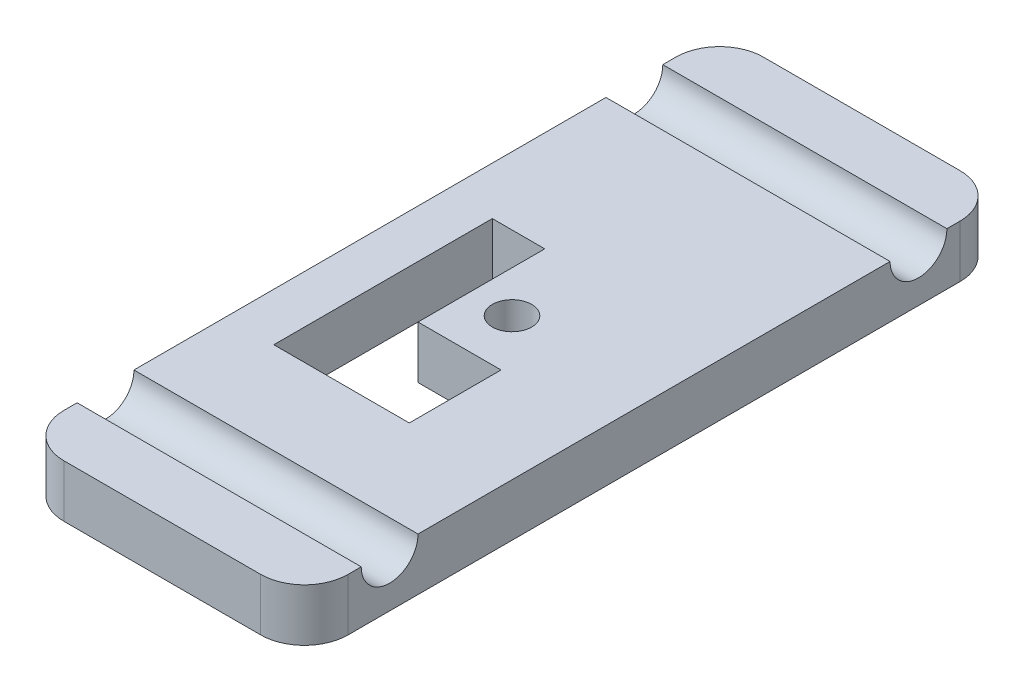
ISO-10303-21;
HEADER;
FILE_DESCRIPTION(('STEP AP214'),'2;1');
FILE_NAME('part.step','',(''),(''),'','','');
FILE_SCHEMA(('AUTOMOTIVE_DESIGN { 1 0 10303 214 1 1 1 1 }'));
ENDSEC;
DATA;
#1=APPLICATION_CONTEXT('core data for automotive mechanical design processes');
#2=APPLICATION_PROTOCOL_DEFINITION('international standard','automotive_design',2000,#1);
#3=PRODUCT_CONTEXT('',#1,'mechanical');
#4=PRODUCT('Part','Part','',(#3));
#5=PRODUCT_RELATED_PRODUCT_CATEGORY('part','',(#4));
#6=PRODUCT_DEFINITION_FORMATION('','',#4);
#7=PRODUCT_DEFINITION_CONTEXT('part definition',#1,'design');
#8=PRODUCT_DEFINITION('design','',#6,#7);
#9=PRODUCT_DEFINITION_SHAPE('','',#8);
#10=(LENGTH_UNIT() NAMED_UNIT(*) SI_UNIT(.MILLI.,.METRE.));
#11=(NAMED_UNIT(*) PLANE_ANGLE_UNIT() SI_UNIT($,.RADIAN.));
#12=(NAMED_UNIT(*) SI_UNIT($,.STERADIAN.) SOLID_ANGLE_UNIT());
#13=UNCERTAINTY_MEASURE_WITH_UNIT(LENGTH_MEASURE(1.E-05),#10,'distance_accuracy_value','');
#14=(GEOMETRIC_REPRESENTATION_CONTEXT(3) GLOBAL_UNCERTAINTY_ASSIGNED_CONTEXT((#13)) GLOBAL_UNIT_ASSIGNED_CONTEXT((#10,
#11,#12)) REPRESENTATION_CONTEXT('',''));
#15=CARTESIAN_POINT('',(0.,0.,0.));
#16=DIRECTION('',(0.,0.,1.));
#17=DIRECTION('',(1.,0.,0.));
#18=AXIS2_PLACEMENT_3D('',#15,#16,#17);
#19=CARTESIAN_POINT('',(0.,0.,0.));
#20=DIRECTION('',(0.,1.,0.));
#21=DIRECTION('',(0.,0.,1.));
#22=AXIS2_PLACEMENT_3D('',#19,#20,#21);
#23=PLANE('',#22);
#24=DIRECTION('',(-1.,0.,0.));
#25=VECTOR('',#24,1.);
#26=CARTESIAN_POINT('',(-32.5,0.,-80.));
#27=LINE('',#26,#25);
#28=CARTESIAN_POINT('',(22.5,0.,-80.));
#29=VERTEX_POINT('',#28);
#30=CARTESIAN_POINT('',(-22.5,0.,-80.));
#31=VERTEX_POINT('',#30);
#32=EDGE_CURVE('E190',#29,#31,#27,.T.);
#33=ORIENTED_EDGE('',*,*,#32,.T.);
#34=CARTESIAN_POINT('',(-22.5,0.,-70.));
#35=DIRECTION('',(0.,1.,0.));
#36=DIRECTION('',(0.,0.,1.));
#37=AXIS2_PLACEMENT_3D('',#34,#35,#36);
#38=CIRCLE('',#37,10.);
#39=CARTESIAN_POINT('',(-32.5,0.,-70.));
#40=VERTEX_POINT('',#39);
#41=EDGE_CURVE('E209',#31,#40,#38,.T.);
#42=ORIENTED_EDGE('',*,*,#41,.T.);
#43=DIRECTION('',(0.,0.,1.));
#44=VECTOR('',#43,1.);
#45=CARTESIAN_POINT('',(-32.5,0.,-80.));
#46=LINE('',#45,#44);
#47=CARTESIAN_POINT('',(-32.5,0.,-67.));
#48=VERTEX_POINT('',#47);
#49=EDGE_CURVE('E187',#40,#48,#46,.T.);
#50=ORIENTED_EDGE('',*,*,#49,.T.);
#51=DIRECTION('',(-1.,0.,0.));
#52=VECTOR('',#51,1.);
#53=CARTESIAN_POINT('',(44.5,0.,-67.));
#54=LINE('',#53,#52);
#55=CARTESIAN_POINT('',(32.5,0.,-67.));
#56=VERTEX_POINT('',#55);
#57=EDGE_CURVE('E199',#56,#48,#54,.T.);
#58=ORIENTED_EDGE('',*,*,#57,.F.);
#59=DIRECTION('',(0.,0.,-1.));
#60=VECTOR('',#59,1.);
#61=CARTESIAN_POINT('',(32.5,0.,-80.));
#62=LINE('',#61,#60);
#63=CARTESIAN_POINT('',(32.5,0.,-70.));
#64=VERTEX_POINT('',#63);
#65=EDGE_CURVE('E245',#56,#64,#62,.T.);
#66=ORIENTED_EDGE('',*,*,#65,.T.);
#67=CARTESIAN_POINT('',(22.5,0.,-70.));
#68=DIRECTION('',(0.,1.,0.));
#69=DIRECTION('',(0.,0.,1.));
#70=AXIS2_PLACEMENT_3D('',#67,#68,#69);
#71=CIRCLE('',#70,10.);
#72=EDGE_CURVE('E207',#64,#29,#71,.T.);
#73=ORIENTED_EDGE('',*,*,#72,.T.);
#74=EDGE_LOOP('',(#33,#42,#50,#58,#66,#73));
#75=FACE_BOUND('',#74,.T.);
#76=ADVANCED_FACE('F35',(#75),#23,.T.);
#77=DIRECTION('',(-1.,0.,0.));
#78=VECTOR('',#77,1.);
#79=CARTESIAN_POINT('',(44.5,0.,-54.));
#80=LINE('',#79,#78);
#81=CARTESIAN_POINT('',(-32.5,0.,-54.));
#82=VERTEX_POINT('',#81);
#83=CARTESIAN_POINT('',(32.5,0.,-54.));
#84=VERTEX_POINT('',#83);
#85=EDGE_CURVE('E170',#82,#84,#80,.F.);
#86=ORIENTED_EDGE('',*,*,#85,.F.);
#87=CARTESIAN_POINT('',(-32.5,0.,54.));
#88=VERTEX_POINT('',#87);
#89=EDGE_CURVE('E179',#82,#88,#46,.T.);
#90=ORIENTED_EDGE('',*,*,#89,.T.);
#91=DIRECTION('',(-1.,0.,0.));
#92=VECTOR('',#91,1.);
#93=CARTESIAN_POINT('',(44.5,0.,54.));
#94=LINE('',#93,#92);
#95=CARTESIAN_POINT('',(32.5,0.,54.));
#96=VERTEX_POINT('',#95);
#97=EDGE_CURVE('E158',#96,#88,#94,.T.);
#98=ORIENTED_EDGE('',*,*,#97,.F.);
#99=EDGE_CURVE('E244',#96,#84,#62,.T.);
#100=ORIENTED_EDGE('',*,*,#99,.T.);
#101=EDGE_LOOP('',(#86,#90,#98,#100));
#102=FACE_BOUND('',#101,.T.);
#103=DIRECTION('',(0.,0.,-1.));
#104=VECTOR('',#103,1.);
#105=CARTESIAN_POINT('',(9.5,0.,33.));
#106=LINE('',#105,#104);
#107=CARTESIAN_POINT('',(9.5,0.,33.));
#108=VERTEX_POINT('',#107);
#109=CARTESIAN_POINT('',(9.5,0.,12.));
#110=VERTEX_POINT('',#109);
#111=EDGE_CURVE('E345',#108,#110,#106,.T.);
#112=ORIENTED_EDGE('',*,*,#111,.F.);
#113=DIRECTION('',(1.,0.,0.));
#114=VECTOR('',#113,1.);
#115=CARTESIAN_POINT('',(9.5,0.,33.));
#116=LINE('',#115,#114);
#117=CARTESIAN_POINT('',(-21.5,0.,33.));
#118=VERTEX_POINT('',#117);
#119=EDGE_CURVE('E350',#118,#108,#116,.T.);
#120=ORIENTED_EDGE('',*,*,#119,.F.);
#121=DIRECTION('',(0.,0.,1.));
#122=VECTOR('',#121,1.);
#123=CARTESIAN_POINT('',(-21.5,0.,-17.));
#124=LINE('',#123,#122);
#125=CARTESIAN_POINT('',(-21.5,0.,-17.));
#126=VERTEX_POINT('',#125);
#127=EDGE_CURVE('E375',#126,#118,#124,.T.);
#128=ORIENTED_EDGE('',*,*,#127,.F.);
#129=DIRECTION('',(-1.,0.,0.));
#130=VECTOR('',#129,1.);
#131=CARTESIAN_POINT('',(-21.5,0.,-17.));
#132=LINE('',#131,#130);
#133=CARTESIAN_POINT('',(-9.5,0.,-17.));
#134=VERTEX_POINT('',#133);
#135=EDGE_CURVE('E372',#134,#126,#132,.T.);
#136=ORIENTED_EDGE('',*,*,#135,.F.);
#137=DIRECTION('',(0.,0.,-1.));
#138=VECTOR('',#137,1.);
#139=CARTESIAN_POINT('',(-9.5,0.,-17.));
#140=LINE('',#139,#138);
#141=CARTESIAN_POINT('',(-9.5,0.,12.));
#142=VERTEX_POINT('',#141);
#143=EDGE_CURVE('E369',#142,#134,#140,.T.);
#144=ORIENTED_EDGE('',*,*,#143,.F.);
#145=DIRECTION('',(-1.,0.,0.));
#146=VECTOR('',#145,1.);
#147=CARTESIAN_POINT('',(-9.5,0.,12.));
#148=LINE('',#147,#146);
#149=EDGE_CURVE('E366',#110,#142,#148,.T.);
#150=ORIENTED_EDGE('',*,*,#149,.F.);
#151=EDGE_LOOP('',(#112,#120,#128,#136,#144,#150));
#152=FACE_BOUND('',#151,.T.);
#153=CARTESIAN_POINT('',(0.,0.,0.));
#154=DIRECTION('',(0.,1.,0.));
#155=DIRECTION('',(0.,0.,1.));
#156=AXIS2_PLACEMENT_3D('',#153,#154,#155);
#157=CIRCLE('',#156,4.5);
#158=CARTESIAN_POINT('',(0.,0.,4.5));
#159=VERTEX_POINT('',#158);
#160=EDGE_CURVE('E260',#159,#159,#157,.T.);
#161=ORIENTED_EDGE('',*,*,#160,.F.);
#162=EDGE_LOOP('',(#161));
#163=FACE_BOUND('',#162,.T.);
#164=ADVANCED_FACE('F185',(#102,#152,#163),#23,.T.);
#165=CARTESIAN_POINT('',(32.5,-12.,-80.));
#166=DIRECTION('',(1.,0.,0.));
#167=DIRECTION('',(0.,0.,-1.));
#168=AXIS2_PLACEMENT_3D('',#165,#166,#167);
#169=PLANE('',#168);
#170=DIRECTION('',(0.,0.,-1.));
#171=VECTOR('',#170,1.);
#172=CARTESIAN_POINT('',(32.5,-12.,-80.));
#173=LINE('',#172,#171);
#174=CARTESIAN_POINT('',(32.5,-12.,70.));
#175=VERTEX_POINT('',#174);
#176=CARTESIAN_POINT('',(32.5,-12.,-70.));
#177=VERTEX_POINT('',#176);
#178=EDGE_CURVE('E195',#175,#177,#173,.T.);
#179=ORIENTED_EDGE('',*,*,#178,.T.);
#180=DIRECTION('',(0.,1.,0.));
#181=VECTOR('',#180,1.);
#182=CARTESIAN_POINT('',(32.5,-12.,-70.));
#183=LINE('',#182,#181);
#184=EDGE_CURVE('E225',#177,#64,#183,.T.);
#185=ORIENTED_EDGE('',*,*,#184,.T.);
#186=ORIENTED_EDGE('',*,*,#65,.F.);
#187=CARTESIAN_POINT('',(32.5,0.,-60.5));
#188=DIRECTION('',(1.,0.,0.));
#189=DIRECTION('',(0.,0.,-1.));
#190=AXIS2_PLACEMENT_3D('',#187,#188,#189);
#191=CIRCLE('',#190,6.5);
#192=EDGE_CURVE('E338',#84,#56,#191,.T.);
#193=ORIENTED_EDGE('',*,*,#192,.F.);
#194=ORIENTED_EDGE('',*,*,#99,.F.);
#195=CARTESIAN_POINT('',(32.5,0.,60.5));
#196=DIRECTION('',(1.,0.,0.));
#197=DIRECTION('',(0.,0.,-1.));
#198=AXIS2_PLACEMENT_3D('',#195,#196,#197);
#199=CIRCLE('',#198,6.49999999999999);
#200=CARTESIAN_POINT('',(32.5,0.,67.));
#201=VERTEX_POINT('',#200);
#202=EDGE_CURVE('E165',#201,#96,#199,.T.);
#203=ORIENTED_EDGE('',*,*,#202,.F.);
#204=CARTESIAN_POINT('',(32.5,0.,70.));
#205=VERTEX_POINT('',#204);
#206=EDGE_CURVE('E239',#205,#201,#62,.T.);
#207=ORIENTED_EDGE('',*,*,#206,.F.);
#208=DIRECTION('',(0.,1.,0.));
#209=VECTOR('',#208,1.);
#210=CARTESIAN_POINT('',(32.5,-12.,70.));
#211=LINE('',#210,#209);
#212=EDGE_CURVE('E223',#205,#175,#211,.F.);
#213=ORIENTED_EDGE('',*,*,#212,.T.);
#214=EDGE_LOOP('',(#179,#185,#186,#193,#194,#203,#207,#213));
#215=FACE_BOUND('',#214,.T.);
#216=ADVANCED_FACE('F242',(#215),#169,.T.);
#217=CARTESIAN_POINT('',(-32.5,-12.,80.));
#218=DIRECTION('',(0.,0.,1.));
#219=DIRECTION('',(1.,0.,0.));
#220=AXIS2_PLACEMENT_3D('',#217,#218,#219);
#221=PLANE('',#220);
#222=DIRECTION('',(1.,0.,0.));
#223=VECTOR('',#222,1.);
#224=CARTESIAN_POINT('',(-32.5,-12.,80.));
#225=LINE('',#224,#223);
#226=CARTESIAN_POINT('',(-22.5,-12.,80.));
#227=VERTEX_POINT('',#226);
#228=CARTESIAN_POINT('',(22.5,-12.,80.));
#229=VERTEX_POINT('',#228);
#230=EDGE_CURVE('E196',#227,#229,#225,.T.);
#231=ORIENTED_EDGE('',*,*,#230,.T.);
#232=DIRECTION('',(0.,1.,0.));
#233=VECTOR('',#232,1.);
#234=CARTESIAN_POINT('',(22.5,-12.,80.));
#235=LINE('',#234,#233);
#236=CARTESIAN_POINT('',(22.5,0.,80.));
#237=VERTEX_POINT('',#236);
#238=EDGE_CURVE('E230',#229,#237,#235,.T.);
#239=ORIENTED_EDGE('',*,*,#238,.T.);
#240=DIRECTION('',(1.,0.,0.));
#241=VECTOR('',#240,1.);
#242=CARTESIAN_POINT('',(-32.5,0.,80.));
#243=LINE('',#242,#241);
#244=CARTESIAN_POINT('',(-22.5,0.,80.));
#245=VERTEX_POINT('',#244);
#246=EDGE_CURVE('E189',#245,#237,#243,.T.);
#247=ORIENTED_EDGE('',*,*,#246,.F.);
#248=DIRECTION('',(0.,1.,0.));
#249=VECTOR('',#248,1.);
#250=CARTESIAN_POINT('',(-22.5,-12.,80.));
#251=LINE('',#250,#249);
#252=EDGE_CURVE('E228',#245,#227,#251,.F.);
#253=ORIENTED_EDGE('',*,*,#252,.T.);
#254=EDGE_LOOP('',(#231,#239,#247,#253));
#255=FACE_BOUND('',#254,.T.);
#256=ADVANCED_FACE('F233',(#255),#221,.T.);
#257=CARTESIAN_POINT('',(-32.5,-12.,-80.));
#258=DIRECTION('',(-1.,0.,0.));
#259=DIRECTION('',(0.,0.,1.));
#260=AXIS2_PLACEMENT_3D('',#257,#258,#259);
#261=PLANE('',#260);
#262=ORIENTED_EDGE('',*,*,#49,.F.);
#263=DIRECTION('',(0.,1.,0.));
#264=VECTOR('',#263,1.);
#265=CARTESIAN_POINT('',(-32.5,-12.,-70.));
#266=LINE('',#265,#264);
#267=CARTESIAN_POINT('',(-32.5,-12.,-70.));
#268=VERTEX_POINT('',#267);
#269=EDGE_CURVE('E213',#40,#268,#266,.F.);
#270=ORIENTED_EDGE('',*,*,#269,.T.);
#271=DIRECTION('',(0.,0.,1.));
#272=VECTOR('',#271,1.);
#273=CARTESIAN_POINT('',(-32.5,-12.,-80.));
#274=LINE('',#273,#272);
#275=CARTESIAN_POINT('',(-32.5,-12.,70.));
#276=VERTEX_POINT('',#275);
#277=EDGE_CURVE('E257',#268,#276,#274,.T.);
#278=ORIENTED_EDGE('',*,*,#277,.T.);
#279=DIRECTION('',(0.,1.,0.));
#280=VECTOR('',#279,1.);
#281=CARTESIAN_POINT('',(-32.5,-12.,70.));
#282=LINE('',#281,#280);
#283=CARTESIAN_POINT('',(-32.5,0.,70.));
#284=VERTEX_POINT('',#283);
#285=EDGE_CURVE('E211',#276,#284,#282,.T.);
#286=ORIENTED_EDGE('',*,*,#285,.T.);
#287=CARTESIAN_POINT('',(-32.5,0.,67.));
#288=VERTEX_POINT('',#287);
#289=EDGE_CURVE('E181',#288,#284,#46,.T.);
#290=ORIENTED_EDGE('',*,*,#289,.F.);
#291=CARTESIAN_POINT('',(-32.5,0.,60.5));
#292=DIRECTION('',(-1.,0.,0.));
#293=DIRECTION('',(0.,0.,1.));
#294=AXIS2_PLACEMENT_3D('',#291,#292,#293);
#295=CIRCLE('',#294,6.49999999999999);
#296=EDGE_CURVE('E162',#88,#288,#295,.T.);
#297=ORIENTED_EDGE('',*,*,#296,.F.);
#298=ORIENTED_EDGE('',*,*,#89,.F.);
#299=CARTESIAN_POINT('',(-32.5,0.,-60.5));
#300=DIRECTION('',(-1.,0.,0.));
#301=DIRECTION('',(0.,0.,1.));
#302=AXIS2_PLACEMENT_3D('',#299,#300,#301);
#303=CIRCLE('',#302,6.5);
#304=EDGE_CURVE('E182',#48,#82,#303,.T.);
#305=ORIENTED_EDGE('',*,*,#304,.F.);
#306=EDGE_LOOP('',(#262,#270,#278,#286,#290,#297,#298,#305));
#307=FACE_BOUND('',#306,.T.);
#308=ADVANCED_FACE('F177',(#307),#261,.T.);
#309=CARTESIAN_POINT('',(-32.5,-12.,-80.));
#310=DIRECTION('',(0.,0.,-1.));
#311=DIRECTION('',(-1.,0.,0.));
#312=AXIS2_PLACEMENT_3D('',#309,#310,#311);
#313=PLANE('',#312);
#314=DIRECTION('',(-1.,0.,0.));
#315=VECTOR('',#314,1.);
#316=CARTESIAN_POINT('',(-32.5,-12.,-80.));
#317=LINE('',#316,#315);
#318=CARTESIAN_POINT('',(22.5,-12.,-80.));
#319=VERTEX_POINT('',#318);
#320=CARTESIAN_POINT('',(-22.5,-12.,-80.));
#321=VERTEX_POINT('',#320);
#322=EDGE_CURVE('E254',#319,#321,#317,.T.);
#323=ORIENTED_EDGE('',*,*,#322,.T.);
#324=DIRECTION('',(0.,1.,0.));
#325=VECTOR('',#324,1.);
#326=CARTESIAN_POINT('',(-22.5,-12.,-80.));
#327=LINE('',#326,#325);
#328=EDGE_CURVE('E204',#321,#31,#327,.T.);
#329=ORIENTED_EDGE('',*,*,#328,.T.);
#330=ORIENTED_EDGE('',*,*,#32,.F.);
#331=DIRECTION('',(0.,1.,0.));
#332=VECTOR('',#331,1.);
#333=CARTESIAN_POINT('',(22.5,-12.,-80.));
#334=LINE('',#333,#332);
#335=EDGE_CURVE('E202',#29,#319,#334,.F.);
#336=ORIENTED_EDGE('',*,*,#335,.T.);
#337=EDGE_LOOP('',(#323,#329,#330,#336));
#338=FACE_BOUND('',#337,.T.);
#339=ADVANCED_FACE('F292',(#338),#313,.T.);
#340=CARTESIAN_POINT('',(0.,-12.,0.));
#341=DIRECTION('',(0.,1.,0.));
#342=DIRECTION('',(0.,0.,1.));
#343=AXIS2_PLACEMENT_3D('',#340,#341,#342);
#344=PLANE('',#343);
#345=DIRECTION('',(1.,0.,0.));
#346=VECTOR('',#345,1.);
#347=CARTESIAN_POINT('',(9.5,-12.,33.));
#348=LINE('',#347,#346);
#349=CARTESIAN_POINT('',(-21.5,-12.,33.));
#350=VERTEX_POINT('',#349);
#351=CARTESIAN_POINT('',(9.5,-12.,33.));
#352=VERTEX_POINT('',#351);
#353=EDGE_CURVE('E362',#350,#352,#348,.T.);
#354=ORIENTED_EDGE('',*,*,#353,.T.);
#355=DIRECTION('',(0.,0.,-1.));
#356=VECTOR('',#355,1.);
#357=CARTESIAN_POINT('',(9.5,-12.,33.));
#358=LINE('',#357,#356);
#359=CARTESIAN_POINT('',(9.5,-12.,12.));
#360=VERTEX_POINT('',#359);
#361=EDGE_CURVE('E346',#352,#360,#358,.T.);
#362=ORIENTED_EDGE('',*,*,#361,.T.);
#363=DIRECTION('',(-1.,0.,0.));
#364=VECTOR('',#363,1.);
#365=CARTESIAN_POINT('',(-9.5,-12.,12.));
#366=LINE('',#365,#364);
#367=CARTESIAN_POINT('',(-9.5,-12.,12.));
#368=VERTEX_POINT('',#367);
#369=EDGE_CURVE('E349',#360,#368,#366,.T.);
#370=ORIENTED_EDGE('',*,*,#369,.T.);
#371=DIRECTION('',(0.,0.,-1.));
#372=VECTOR('',#371,1.);
#373=CARTESIAN_POINT('',(-9.5,-12.,-17.));
#374=LINE('',#373,#372);
#375=CARTESIAN_POINT('',(-9.5,-12.,-17.));
#376=VERTEX_POINT('',#375);
#377=EDGE_CURVE('E353',#368,#376,#374,.T.);
#378=ORIENTED_EDGE('',*,*,#377,.T.);
#379=DIRECTION('',(-1.,0.,0.));
#380=VECTOR('',#379,1.);
#381=CARTESIAN_POINT('',(-21.5,-12.,-17.));
#382=LINE('',#381,#380);
#383=CARTESIAN_POINT('',(-21.5,-12.,-17.));
#384=VERTEX_POINT('',#383);
#385=EDGE_CURVE('E356',#376,#384,#382,.T.);
#386=ORIENTED_EDGE('',*,*,#385,.T.);
#387=DIRECTION('',(0.,0.,1.));
#388=VECTOR('',#387,1.);
#389=CARTESIAN_POINT('',(-21.5,-12.,-17.));
#390=LINE('',#389,#388);
#391=EDGE_CURVE('E359',#384,#350,#390,.T.);
#392=ORIENTED_EDGE('',*,*,#391,.T.);
#393=EDGE_LOOP('',(#354,#362,#370,#378,#386,#392));
#394=FACE_BOUND('',#393,.T.);
#395=CARTESIAN_POINT('',(0.,-12.,0.));
#396=DIRECTION('',(0.,1.,0.));
#397=DIRECTION('',(0.,0.,1.));
#398=AXIS2_PLACEMENT_3D('',#395,#396,#397);
#399=CIRCLE('',#398,4.5);
#400=CARTESIAN_POINT('',(0.,-12.,4.5));
#401=VERTEX_POINT('',#400);
#402=EDGE_CURVE('E391',#401,#401,#399,.T.);
#403=ORIENTED_EDGE('',*,*,#402,.T.);
#404=EDGE_LOOP('',(#403));
#405=FACE_BOUND('',#404,.T.);
#406=ORIENTED_EDGE('',*,*,#277,.F.);
#407=CARTESIAN_POINT('',(-22.5,-12.,-70.));
#408=DIRECTION('',(0.,1.,0.));
#409=DIRECTION('',(0.,0.,1.));
#410=AXIS2_PLACEMENT_3D('',#407,#408,#409);
#411=CIRCLE('',#410,10.);
#412=EDGE_CURVE('E221',#268,#321,#411,.F.);
#413=ORIENTED_EDGE('',*,*,#412,.T.);
#414=ORIENTED_EDGE('',*,*,#322,.F.);
#415=CARTESIAN_POINT('',(22.5,-12.,-70.));
#416=DIRECTION('',(0.,1.,0.));
#417=DIRECTION('',(0.,0.,1.));
#418=AXIS2_PLACEMENT_3D('',#415,#416,#417);
#419=CIRCLE('',#418,10.);
#420=EDGE_CURVE('E219',#319,#177,#419,.F.);
#421=ORIENTED_EDGE('',*,*,#420,.T.);
#422=ORIENTED_EDGE('',*,*,#178,.F.);
#423=CARTESIAN_POINT('',(22.5,-12.,70.));
#424=DIRECTION('',(0.,1.,0.));
#425=DIRECTION('',(0.,0.,1.));
#426=AXIS2_PLACEMENT_3D('',#423,#424,#425);
#427=CIRCLE('',#426,10.);
#428=EDGE_CURVE('E217',#175,#229,#427,.F.);
#429=ORIENTED_EDGE('',*,*,#428,.T.);
#430=ORIENTED_EDGE('',*,*,#230,.F.);
#431=CARTESIAN_POINT('',(-22.5,-12.,70.));
#432=DIRECTION('',(0.,1.,0.));
#433=DIRECTION('',(0.,0.,1.));
#434=AXIS2_PLACEMENT_3D('',#431,#432,#433);
#435=CIRCLE('',#434,10.);
#436=EDGE_CURVE('E215',#227,#276,#435,.F.);
#437=ORIENTED_EDGE('',*,*,#436,.T.);
#438=EDGE_LOOP('',(#406,#413,#414,#421,#422,#429,#430,#437));
#439=FACE_BOUND('',#438,.T.);
#440=ADVANCED_FACE('F249',(#394,#405,#439),#344,.F.);
#441=ORIENTED_EDGE('',*,*,#246,.T.);
#442=CARTESIAN_POINT('',(22.5,0.,70.));
#443=DIRECTION('',(0.,1.,0.));
#444=DIRECTION('',(0.,0.,1.));
#445=AXIS2_PLACEMENT_3D('',#442,#443,#444);
#446=CIRCLE('',#445,10.);
#447=EDGE_CURVE('E11',#237,#205,#446,.T.);
#448=ORIENTED_EDGE('',*,*,#447,.T.);
#449=ORIENTED_EDGE('',*,*,#206,.T.);
#450=DIRECTION('',(-1.,0.,0.));
#451=VECTOR('',#450,1.);
#452=CARTESIAN_POINT('',(44.5,0.,67.));
#453=LINE('',#452,#451);
#454=EDGE_CURVE('E171',#288,#201,#453,.F.);
#455=ORIENTED_EDGE('',*,*,#454,.F.);
#456=ORIENTED_EDGE('',*,*,#289,.T.);
#457=CARTESIAN_POINT('',(-22.5,0.,70.));
#458=DIRECTION('',(0.,1.,0.));
#459=DIRECTION('',(0.,0.,1.));
#460=AXIS2_PLACEMENT_3D('',#457,#458,#459);
#461=CIRCLE('',#460,10.);
#462=EDGE_CURVE('E43',#284,#245,#461,.T.);
#463=ORIENTED_EDGE('',*,*,#462,.T.);
#464=EDGE_LOOP('',(#441,#448,#449,#455,#456,#463));
#465=FACE_BOUND('',#464,.T.);
#466=ADVANCED_FACE('F237',(#465),#23,.T.);
#467=CARTESIAN_POINT('',(0.,-12.,0.));
#468=DIRECTION('',(0.,1.,0.));
#469=DIRECTION('',(0.,0.,1.));
#470=AXIS2_PLACEMENT_3D('',#467,#468,#469);
#471=CYLINDRICAL_SURFACE('',#470,4.5);
#472=ORIENTED_EDGE('',*,*,#402,.F.);
#473=EDGE_LOOP('',(#472));
#474=FACE_BOUND('',#473,.T.);
#475=ORIENTED_EDGE('',*,*,#160,.T.);
#476=EDGE_LOOP('',(#475));
#477=FACE_BOUND('',#476,.T.);
#478=ADVANCED_FACE('F284',(#474,#477),#471,.F.);
#479=CARTESIAN_POINT('',(9.5,-12.,33.));
#480=DIRECTION('',(1.,0.,0.));
#481=DIRECTION('',(0.,0.,-1.));
#482=AXIS2_PLACEMENT_3D('',#479,#480,#481);
#483=PLANE('',#482);
#484=ORIENTED_EDGE('',*,*,#111,.T.);
#485=DIRECTION('',(0.,1.,0.));
#486=VECTOR('',#485,1.);
#487=CARTESIAN_POINT('',(9.5,-12.,12.));
#488=LINE('',#487,#486);
#489=EDGE_CURVE('E364',#360,#110,#488,.T.);
#490=ORIENTED_EDGE('',*,*,#489,.F.);
#491=ORIENTED_EDGE('',*,*,#361,.F.);
#492=DIRECTION('',(0.,1.,0.));
#493=VECTOR('',#492,1.);
#494=CARTESIAN_POINT('',(9.5,-12.,33.));
#495=LINE('',#494,#493);
#496=EDGE_CURVE('E380',#352,#108,#495,.T.);
#497=ORIENTED_EDGE('',*,*,#496,.T.);
#498=EDGE_LOOP('',(#484,#490,#491,#497));
#499=FACE_BOUND('',#498,.T.);
#500=ADVANCED_FACE('F289',(#499),#483,.F.);
#501=CARTESIAN_POINT('',(9.5,-12.,33.));
#502=DIRECTION('',(0.,0.,1.));
#503=DIRECTION('',(1.,0.,0.));
#504=AXIS2_PLACEMENT_3D('',#501,#502,#503);
#505=PLANE('',#504);
#506=ORIENTED_EDGE('',*,*,#119,.T.);
#507=ORIENTED_EDGE('',*,*,#496,.F.);
#508=ORIENTED_EDGE('',*,*,#353,.F.);
#509=DIRECTION('',(0.,1.,0.));
#510=VECTOR('',#509,1.);
#511=CARTESIAN_POINT('',(-21.5,-12.,33.));
#512=LINE('',#511,#510);
#513=EDGE_CURVE('E382',#350,#118,#512,.T.);
#514=ORIENTED_EDGE('',*,*,#513,.T.);
#515=EDGE_LOOP('',(#506,#507,#508,#514));
#516=FACE_BOUND('',#515,.T.);
#517=ADVANCED_FACE('F304',(#516),#505,.F.);
#518=CARTESIAN_POINT('',(-21.5,-12.,-17.));
#519=DIRECTION('',(-1.,0.,0.));
#520=DIRECTION('',(0.,0.,1.));
#521=AXIS2_PLACEMENT_3D('',#518,#519,#520);
#522=PLANE('',#521);
#523=ORIENTED_EDGE('',*,*,#127,.T.);
#524=ORIENTED_EDGE('',*,*,#513,.F.);
#525=ORIENTED_EDGE('',*,*,#391,.F.);
#526=DIRECTION('',(0.,1.,0.));
#527=VECTOR('',#526,1.);
#528=CARTESIAN_POINT('',(-21.5,-12.,-17.));
#529=LINE('',#528,#527);
#530=EDGE_CURVE('E384',#384,#126,#529,.T.);
#531=ORIENTED_EDGE('',*,*,#530,.T.);
#532=EDGE_LOOP('',(#523,#524,#525,#531));
#533=FACE_BOUND('',#532,.T.);
#534=ADVANCED_FACE('F317',(#533),#522,.F.);
#535=CARTESIAN_POINT('',(-21.5,-12.,-17.));
#536=DIRECTION('',(0.,0.,-1.));
#537=DIRECTION('',(-1.,0.,0.));
#538=AXIS2_PLACEMENT_3D('',#535,#536,#537);
#539=PLANE('',#538);
#540=ORIENTED_EDGE('',*,*,#135,.T.);
#541=ORIENTED_EDGE('',*,*,#530,.F.);
#542=ORIENTED_EDGE('',*,*,#385,.F.);
#543=DIRECTION('',(0.,1.,0.));
#544=VECTOR('',#543,1.);
#545=CARTESIAN_POINT('',(-9.5,-12.,-17.));
#546=LINE('',#545,#544);
#547=EDGE_CURVE('E386',#376,#134,#546,.T.);
#548=ORIENTED_EDGE('',*,*,#547,.T.);
#549=EDGE_LOOP('',(#540,#541,#542,#548));
#550=FACE_BOUND('',#549,.T.);
#551=ADVANCED_FACE('F313',(#550),#539,.F.);
#552=CARTESIAN_POINT('',(-9.5,-12.,-17.));
#553=DIRECTION('',(1.,0.,0.));
#554=DIRECTION('',(0.,0.,-1.));
#555=AXIS2_PLACEMENT_3D('',#552,#553,#554);
#556=PLANE('',#555);
#557=ORIENTED_EDGE('',*,*,#143,.T.);
#558=ORIENTED_EDGE('',*,*,#547,.F.);
#559=ORIENTED_EDGE('',*,*,#377,.F.);
#560=DIRECTION('',(0.,1.,0.));
#561=VECTOR('',#560,1.);
#562=CARTESIAN_POINT('',(-9.5,-12.,12.));
#563=LINE('',#562,#561);
#564=EDGE_CURVE('E388',#368,#142,#563,.T.);
#565=ORIENTED_EDGE('',*,*,#564,.T.);
#566=EDGE_LOOP('',(#557,#558,#559,#565));
#567=FACE_BOUND('',#566,.T.);
#568=ADVANCED_FACE('F309',(#567),#556,.F.);
#569=CARTESIAN_POINT('',(-9.5,-12.,12.));
#570=DIRECTION('',(0.,0.,-1.));
#571=DIRECTION('',(-1.,0.,0.));
#572=AXIS2_PLACEMENT_3D('',#569,#570,#571);
#573=PLANE('',#572);
#574=ORIENTED_EDGE('',*,*,#149,.T.);
#575=ORIENTED_EDGE('',*,*,#564,.F.);
#576=ORIENTED_EDGE('',*,*,#369,.F.);
#577=ORIENTED_EDGE('',*,*,#489,.T.);
#578=EDGE_LOOP('',(#574,#575,#576,#577));
#579=FACE_BOUND('',#578,.T.);
#580=ADVANCED_FACE('F306',(#579),#573,.F.);
#581=CARTESIAN_POINT('',(44.5,0.,60.5));
#582=DIRECTION('',(-1.,0.,0.));
#583=DIRECTION('',(0.,0.,1.));
#584=AXIS2_PLACEMENT_3D('',#581,#582,#583);
#585=CYLINDRICAL_SURFACE('',#584,6.49999999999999);
#586=ORIENTED_EDGE('',*,*,#97,.T.);
#587=ORIENTED_EDGE('',*,*,#296,.T.);
#588=ORIENTED_EDGE('',*,*,#454,.T.);
#589=ORIENTED_EDGE('',*,*,#202,.T.);
#590=EDGE_LOOP('',(#586,#587,#588,#589));
#591=FACE_BOUND('',#590,.T.);
#592=ADVANCED_FACE('F160',(#591),#585,.F.);
#593=CARTESIAN_POINT('',(44.5,0.,-60.5));
#594=DIRECTION('',(-1.,0.,0.));
#595=DIRECTION('',(0.,0.,1.));
#596=AXIS2_PLACEMENT_3D('',#593,#594,#595);
#597=CYLINDRICAL_SURFACE('',#596,6.5);
#598=ORIENTED_EDGE('',*,*,#57,.T.);
#599=ORIENTED_EDGE('',*,*,#304,.T.);
#600=ORIENTED_EDGE('',*,*,#85,.T.);
#601=ORIENTED_EDGE('',*,*,#192,.T.);
#602=EDGE_LOOP('',(#598,#599,#600,#601));
#603=FACE_BOUND('',#602,.T.);
#604=ADVANCED_FACE('F327',(#603),#597,.F.);
#605=CARTESIAN_POINT('',(-22.5,-12.,-70.));
#606=DIRECTION('',(0.,1.,0.));
#607=DIRECTION('',(0.,0.,1.));
#608=AXIS2_PLACEMENT_3D('',#605,#606,#607);
#609=CYLINDRICAL_SURFACE('',#608,10.);
#610=ORIENTED_EDGE('',*,*,#412,.F.);
#611=ORIENTED_EDGE('',*,*,#269,.F.);
#612=ORIENTED_EDGE('',*,*,#41,.F.);
#613=ORIENTED_EDGE('',*,*,#328,.F.);
#614=EDGE_LOOP('',(#610,#611,#612,#613));
#615=FACE_BOUND('',#614,.T.);
#616=ADVANCED_FACE('F329',(#615),#609,.T.);
#617=CARTESIAN_POINT('',(22.5,-12.,-70.));
#618=DIRECTION('',(0.,1.,0.));
#619=DIRECTION('',(0.,0.,1.));
#620=AXIS2_PLACEMENT_3D('',#617,#618,#619);
#621=CYLINDRICAL_SURFACE('',#620,10.);
#622=ORIENTED_EDGE('',*,*,#420,.F.);
#623=ORIENTED_EDGE('',*,*,#335,.F.);
#624=ORIENTED_EDGE('',*,*,#72,.F.);
#625=ORIENTED_EDGE('',*,*,#184,.F.);
#626=EDGE_LOOP('',(#622,#623,#624,#625));
#627=FACE_BOUND('',#626,.T.);
#628=ADVANCED_FACE('F273',(#627),#621,.T.);
#629=CARTESIAN_POINT('',(22.5,-12.,70.));
#630=DIRECTION('',(0.,1.,0.));
#631=DIRECTION('',(0.,0.,1.));
#632=AXIS2_PLACEMENT_3D('',#629,#630,#631);
#633=CYLINDRICAL_SURFACE('',#632,10.);
#634=ORIENTED_EDGE('',*,*,#428,.F.);
#635=ORIENTED_EDGE('',*,*,#212,.F.);
#636=ORIENTED_EDGE('',*,*,#447,.F.);
#637=ORIENTED_EDGE('',*,*,#238,.F.);
#638=EDGE_LOOP('',(#634,#635,#636,#637));
#639=FACE_BOUND('',#638,.T.);
#640=ADVANCED_FACE('F246',(#639),#633,.T.);
#641=CARTESIAN_POINT('',(-22.5,-12.,70.));
#642=DIRECTION('',(0.,1.,0.));
#643=DIRECTION('',(0.,0.,1.));
#644=AXIS2_PLACEMENT_3D('',#641,#642,#643);
#645=CYLINDRICAL_SURFACE('',#644,10.);
#646=ORIENTED_EDGE('',*,*,#436,.F.);
#647=ORIENTED_EDGE('',*,*,#252,.F.);
#648=ORIENTED_EDGE('',*,*,#462,.F.);
#649=ORIENTED_EDGE('',*,*,#285,.F.);
#650=EDGE_LOOP('',(#646,#647,#648,#649));
#651=FACE_BOUND('',#650,.T.);
#652=ADVANCED_FACE('F37',(#651),#645,.T.);
#653=CLOSED_SHELL('',(#76,#164,#216,#256,#308,#339,#440,#466,#478,#500,#517,#534,#551,#568,#580,
#592,#604,#616,#628,#640,#652));
#654=MANIFOLD_SOLID_BREP('B2',#653);
#655=ADVANCED_BREP_SHAPE_REPRESENTATION('',(#18,#654),#14);
#656=SHAPE_DEFINITION_REPRESENTATION(#9,#655);
ENDSEC;
END-ISO-10303-21;
